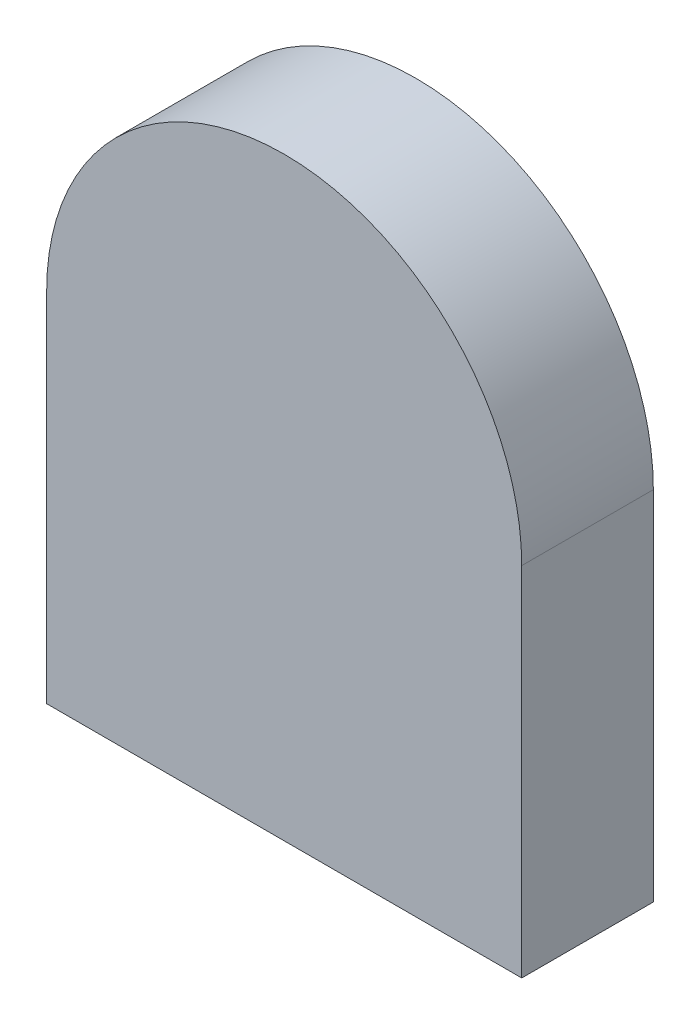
ISO-10303-21;
HEADER;
FILE_DESCRIPTION(('STEP AP214'),'2;1');
FILE_NAME('part.step','',(''),(''),'','','');
FILE_SCHEMA(('AUTOMOTIVE_DESIGN { 1 0 10303 214 1 1 1 1 }'));
ENDSEC;
DATA;
#1=APPLICATION_CONTEXT('core data for automotive mechanical design processes');
#2=APPLICATION_PROTOCOL_DEFINITION('international standard','automotive_design',2000,#1);
#3=PRODUCT_CONTEXT('',#1,'mechanical');
#4=PRODUCT('Part','Part','',(#3));
#5=PRODUCT_RELATED_PRODUCT_CATEGORY('part','',(#4));
#6=PRODUCT_DEFINITION_FORMATION('','',#4);
#7=PRODUCT_DEFINITION_CONTEXT('part definition',#1,'design');
#8=PRODUCT_DEFINITION('design','',#6,#7);
#9=PRODUCT_DEFINITION_SHAPE('','',#8);
#10=(LENGTH_UNIT() NAMED_UNIT(*) SI_UNIT(.MILLI.,.METRE.));
#11=(NAMED_UNIT(*) PLANE_ANGLE_UNIT() SI_UNIT($,.RADIAN.));
#12=(NAMED_UNIT(*) SI_UNIT($,.STERADIAN.) SOLID_ANGLE_UNIT());
#13=UNCERTAINTY_MEASURE_WITH_UNIT(LENGTH_MEASURE(1.E-05),#10,'distance_accuracy_value','');
#14=(GEOMETRIC_REPRESENTATION_CONTEXT(3) GLOBAL_UNCERTAINTY_ASSIGNED_CONTEXT((#13)) GLOBAL_UNIT_ASSIGNED_CONTEXT((#10,
#11,#12)) REPRESENTATION_CONTEXT('',''));
#15=CARTESIAN_POINT('',(0.,0.,0.));
#16=DIRECTION('',(0.,0.,1.));
#17=DIRECTION('',(1.,0.,0.));
#18=AXIS2_PLACEMENT_3D('',#15,#16,#17);
#19=CARTESIAN_POINT('',(-0.961790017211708,-0.961790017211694,0.));
#20=DIRECTION('',(0.,0.,-1.));
#21=DIRECTION('',(-1.,0.,0.));
#22=AXIS2_PLACEMENT_3D('',#19,#20,#21);
#23=CYLINDRICAL_SURFACE('',#22,34.3839931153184);
#24=DIRECTION('',(0.,0.,-1.));
#25=VECTOR('',#24,1.);
#26=CARTESIAN_POINT('',(33.4222030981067,-0.961790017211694,19.05));
#27=LINE('',#26,#25);
#28=CARTESIAN_POINT('',(33.4222030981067,-0.961790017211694,0.));
#29=VERTEX_POINT('',#28);
#30=CARTESIAN_POINT('',(33.4222030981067,-0.961790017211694,19.05));
#31=VERTEX_POINT('',#30);
#32=EDGE_CURVE('E91',#29,#31,#27,.F.);
#33=ORIENTED_EDGE('',*,*,#32,.F.);
#34=CARTESIAN_POINT('',(-0.961790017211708,-0.961790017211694,0.));
#35=DIRECTION('',(0.,0.,1.));
#36=DIRECTION('',(1.,0.,0.));
#37=AXIS2_PLACEMENT_3D('',#34,#35,#36);
#38=CIRCLE('',#37,34.3839931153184);
#39=CARTESIAN_POINT('',(-35.3457831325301,-0.961790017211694,0.));
#40=VERTEX_POINT('',#39);
#41=EDGE_CURVE('E40',#40,#29,#38,.F.);
#42=ORIENTED_EDGE('',*,*,#41,.F.);
#43=DIRECTION('',(0.,0.,-1.));
#44=VECTOR('',#43,1.);
#45=CARTESIAN_POINT('',(-35.3457831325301,-0.961790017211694,19.05));
#46=LINE('',#45,#44);
#47=CARTESIAN_POINT('',(-35.3457831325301,-0.961790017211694,19.05));
#48=VERTEX_POINT('',#47);
#49=EDGE_CURVE('E76',#48,#40,#46,.T.);
#50=ORIENTED_EDGE('',*,*,#49,.F.);
#51=CARTESIAN_POINT('',(-0.961790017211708,-0.961790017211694,19.05));
#52=DIRECTION('',(0.,0.,1.));
#53=DIRECTION('',(1.,0.,0.));
#54=AXIS2_PLACEMENT_3D('',#51,#52,#53);
#55=CIRCLE('',#54,34.3839931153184);
#56=EDGE_CURVE('E11',#31,#48,#55,.T.);
#57=ORIENTED_EDGE('',*,*,#56,.F.);
#58=EDGE_LOOP('',(#33,#42,#50,#57));
#59=FACE_BOUND('',#58,.T.);
#60=ADVANCED_FACE('F33',(#59),#23,.T.);
#61=CARTESIAN_POINT('',(-35.3457831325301,33.4222030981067,19.05));
#62=DIRECTION('',(1.,0.,0.));
#63=DIRECTION('',(0.,0.,-1.));
#64=AXIS2_PLACEMENT_3D('',#61,#62,#63);
#65=PLANE('',#64);
#66=DIRECTION('',(0.,-1.,0.));
#67=VECTOR('',#66,1.);
#68=CARTESIAN_POINT('',(-35.3457831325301,33.4222030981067,19.05));
#69=LINE('',#68,#67);
#70=CARTESIAN_POINT('',(-35.3457831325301,-52.6580034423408,19.05));
#71=VERTEX_POINT('',#70);
#72=EDGE_CURVE('E103',#48,#71,#69,.T.);
#73=ORIENTED_EDGE('',*,*,#72,.F.);
#74=ORIENTED_EDGE('',*,*,#49,.T.);
#75=DIRECTION('',(0.,-1.,0.));
#76=VECTOR('',#75,1.);
#77=CARTESIAN_POINT('',(-35.3457831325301,33.4222030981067,0.));
#78=LINE('',#77,#76);
#79=CARTESIAN_POINT('',(-35.3457831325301,-52.6580034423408,0.));
#80=VERTEX_POINT('',#79);
#81=EDGE_CURVE('E70',#40,#80,#78,.T.);
#82=ORIENTED_EDGE('',*,*,#81,.T.);
#83=DIRECTION('',(0.,0.,-1.));
#84=VECTOR('',#83,1.);
#85=CARTESIAN_POINT('',(-35.3457831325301,-52.6580034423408,19.05));
#86=LINE('',#85,#84);
#87=EDGE_CURVE('E75',#71,#80,#86,.T.);
#88=ORIENTED_EDGE('',*,*,#87,.F.);
#89=EDGE_LOOP('',(#73,#74,#82,#88));
#90=FACE_BOUND('',#89,.T.);
#91=ADVANCED_FACE('F73',(#90),#65,.F.);
#92=CARTESIAN_POINT('',(-35.3457831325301,-52.6580034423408,19.05));
#93=DIRECTION('',(0.,1.,0.));
#94=DIRECTION('',(0.,0.,1.));
#95=AXIS2_PLACEMENT_3D('',#92,#93,#94);
#96=PLANE('',#95);
#97=DIRECTION('',(1.,0.,0.));
#98=VECTOR('',#97,1.);
#99=CARTESIAN_POINT('',(-35.3457831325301,-52.6580034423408,0.));
#100=LINE('',#99,#98);
#101=CARTESIAN_POINT('',(33.4222030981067,-52.6580034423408,0.));
#102=VERTEX_POINT('',#101);
#103=EDGE_CURVE('E78',#80,#102,#100,.T.);
#104=ORIENTED_EDGE('',*,*,#103,.T.);
#105=DIRECTION('',(0.,0.,-1.));
#106=VECTOR('',#105,1.);
#107=CARTESIAN_POINT('',(33.4222030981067,-52.6580034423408,19.05));
#108=LINE('',#107,#106);
#109=CARTESIAN_POINT('',(33.4222030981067,-52.6580034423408,19.05));
#110=VERTEX_POINT('',#109);
#111=EDGE_CURVE('E92',#110,#102,#108,.T.);
#112=ORIENTED_EDGE('',*,*,#111,.F.);
#113=DIRECTION('',(1.,0.,0.));
#114=VECTOR('',#113,1.);
#115=CARTESIAN_POINT('',(-35.3457831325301,-52.6580034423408,19.05));
#116=LINE('',#115,#114);
#117=EDGE_CURVE('E90',#71,#110,#116,.T.);
#118=ORIENTED_EDGE('',*,*,#117,.F.);
#119=ORIENTED_EDGE('',*,*,#87,.T.);
#120=EDGE_LOOP('',(#104,#112,#118,#119));
#121=FACE_BOUND('',#120,.T.);
#122=ADVANCED_FACE('F89',(#121),#96,.F.);
#123=CARTESIAN_POINT('',(33.4222030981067,33.4222030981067,19.05));
#124=DIRECTION('',(-1.,0.,0.));
#125=DIRECTION('',(0.,0.,1.));
#126=AXIS2_PLACEMENT_3D('',#123,#124,#125);
#127=PLANE('',#126);
#128=DIRECTION('',(0.,1.,0.));
#129=VECTOR('',#128,1.);
#130=CARTESIAN_POINT('',(33.4222030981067,33.4222030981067,0.));
#131=LINE('',#130,#129);
#132=EDGE_CURVE('E83',#102,#29,#131,.T.);
#133=ORIENTED_EDGE('',*,*,#132,.T.);
#134=ORIENTED_EDGE('',*,*,#32,.T.);
#135=DIRECTION('',(0.,1.,0.));
#136=VECTOR('',#135,1.);
#137=CARTESIAN_POINT('',(33.4222030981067,33.4222030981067,19.05));
#138=LINE('',#137,#136);
#139=EDGE_CURVE('E96',#110,#31,#138,.T.);
#140=ORIENTED_EDGE('',*,*,#139,.F.);
#141=ORIENTED_EDGE('',*,*,#111,.T.);
#142=EDGE_LOOP('',(#133,#134,#140,#141));
#143=FACE_BOUND('',#142,.T.);
#144=ADVANCED_FACE('F102',(#143),#127,.F.);
#145=CARTESIAN_POINT('',(-35.3457831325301,-52.6580034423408,19.05));
#146=DIRECTION('',(0.,0.,1.));
#147=DIRECTION('',(1.,0.,0.));
#148=AXIS2_PLACEMENT_3D('',#145,#146,#147);
#149=PLANE('',#148);
#150=ORIENTED_EDGE('',*,*,#139,.T.);
#151=ORIENTED_EDGE('',*,*,#56,.T.);
#152=ORIENTED_EDGE('',*,*,#72,.T.);
#153=ORIENTED_EDGE('',*,*,#117,.T.);
#154=EDGE_LOOP('',(#150,#151,#152,#153));
#155=FACE_BOUND('',#154,.T.);
#156=ADVANCED_FACE('F107',(#155),#149,.T.);
#157=CARTESIAN_POINT('',(-35.3457831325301,-52.6580034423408,0.));
#158=DIRECTION('',(0.,0.,1.));
#159=DIRECTION('',(1.,0.,0.));
#160=AXIS2_PLACEMENT_3D('',#157,#158,#159);
#161=PLANE('',#160);
#162=ORIENTED_EDGE('',*,*,#81,.F.);
#163=ORIENTED_EDGE('',*,*,#41,.T.);
#164=ORIENTED_EDGE('',*,*,#132,.F.);
#165=ORIENTED_EDGE('',*,*,#103,.F.);
#166=EDGE_LOOP('',(#162,#163,#164,#165));
#167=FACE_BOUND('',#166,.T.);
#168=ADVANCED_FACE('F81',(#167),#161,.F.);
#169=CLOSED_SHELL('',(#60,#91,#122,#144,#156,#168));
#170=MANIFOLD_SOLID_BREP('B2',#169);
#171=ADVANCED_BREP_SHAPE_REPRESENTATION('',(#18,#170),#14);
#172=SHAPE_DEFINITION_REPRESENTATION(#9,#171);
ENDSEC;
END-ISO-10303-21;
